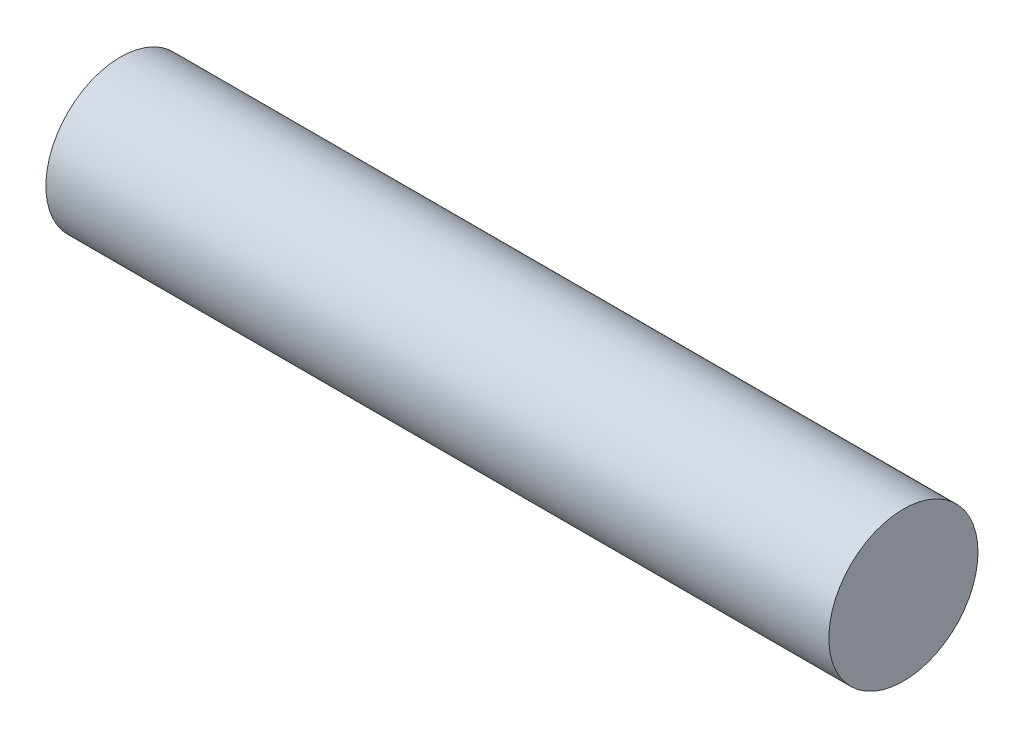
ISO-10303-21;
HEADER;
FILE_DESCRIPTION(('STEP AP214'),'2;1');
FILE_NAME('part.step','',(''),(''),'','','');
FILE_SCHEMA(('AUTOMOTIVE_DESIGN { 1 0 10303 214 1 1 1 1 }'));
ENDSEC;
DATA;
#1=APPLICATION_CONTEXT('core data for automotive mechanical design processes');
#2=APPLICATION_PROTOCOL_DEFINITION('international standard','automotive_design',2000,#1);
#3=PRODUCT_CONTEXT('',#1,'mechanical');
#4=PRODUCT('Part','Part','',(#3));
#5=PRODUCT_RELATED_PRODUCT_CATEGORY('part','',(#4));
#6=PRODUCT_DEFINITION_FORMATION('','',#4);
#7=PRODUCT_DEFINITION_CONTEXT('part definition',#1,'design');
#8=PRODUCT_DEFINITION('design','',#6,#7);
#9=PRODUCT_DEFINITION_SHAPE('','',#8);
#10=(LENGTH_UNIT() NAMED_UNIT(*) SI_UNIT(.MILLI.,.METRE.));
#11=(NAMED_UNIT(*) PLANE_ANGLE_UNIT() SI_UNIT($,.RADIAN.));
#12=(NAMED_UNIT(*) SI_UNIT($,.STERADIAN.) SOLID_ANGLE_UNIT());
#13=UNCERTAINTY_MEASURE_WITH_UNIT(LENGTH_MEASURE(1.E-05),#10,'distance_accuracy_value','');
#14=(GEOMETRIC_REPRESENTATION_CONTEXT(3) GLOBAL_UNCERTAINTY_ASSIGNED_CONTEXT((#13)) GLOBAL_UNIT_ASSIGNED_CONTEXT((#10,
#11,#12)) REPRESENTATION_CONTEXT('',''));
#15=CARTESIAN_POINT('',(0.,0.,0.));
#16=DIRECTION('',(0.,0.,1.));
#17=DIRECTION('',(1.,0.,0.));
#18=AXIS2_PLACEMENT_3D('',#15,#16,#17);
#19=CARTESIAN_POINT('',(50.,0.,0.));
#20=DIRECTION('',(-1.,0.,0.));
#21=DIRECTION('',(0.,0.,1.));
#22=AXIS2_PLACEMENT_3D('',#19,#20,#21);
#23=CYLINDRICAL_SURFACE('',#22,4.7625);
#24=CARTESIAN_POINT('',(50.,0.,0.));
#25=DIRECTION('',(1.,0.,0.));
#26=DIRECTION('',(0.,0.,-1.));
#27=AXIS2_PLACEMENT_3D('',#24,#25,#26);
#28=CIRCLE('',#27,4.7625);
#29=CARTESIAN_POINT('',(50.,0.,-4.7625));
#30=VERTEX_POINT('',#29);
#31=EDGE_CURVE('E10',#30,#30,#28,.T.);
#32=ORIENTED_EDGE('',*,*,#31,.F.);
#33=EDGE_LOOP('',(#32));
#34=FACE_BOUND('',#33,.T.);
#35=CARTESIAN_POINT('',(0.,0.,0.));
#36=DIRECTION('',(1.,0.,0.));
#37=DIRECTION('',(0.,0.,-1.));
#38=AXIS2_PLACEMENT_3D('',#35,#36,#37);
#39=CIRCLE('',#38,4.7625);
#40=CARTESIAN_POINT('',(0.,0.,-4.7625));
#41=VERTEX_POINT('',#40);
#42=EDGE_CURVE('E33',#41,#41,#39,.T.);
#43=ORIENTED_EDGE('',*,*,#42,.T.);
#44=EDGE_LOOP('',(#43));
#45=FACE_BOUND('',#44,.T.);
#46=ADVANCED_FACE('F30',(#34,#45),#23,.T.);
#47=CARTESIAN_POINT('',(50.,0.,0.));
#48=DIRECTION('',(1.,0.,0.));
#49=DIRECTION('',(0.,0.,-1.));
#50=AXIS2_PLACEMENT_3D('',#47,#48,#49);
#51=PLANE('',#50);
#52=ORIENTED_EDGE('',*,*,#31,.T.);
#53=EDGE_LOOP('',(#52));
#54=FACE_BOUND('',#53,.T.);
#55=ADVANCED_FACE('F45',(#54),#51,.T.);
#56=CARTESIAN_POINT('',(0.,0.,0.));
#57=DIRECTION('',(1.,0.,0.));
#58=DIRECTION('',(0.,0.,-1.));
#59=AXIS2_PLACEMENT_3D('',#56,#57,#58);
#60=PLANE('',#59);
#61=ORIENTED_EDGE('',*,*,#42,.F.);
#62=EDGE_LOOP('',(#61));
#63=FACE_BOUND('',#62,.T.);
#64=ADVANCED_FACE('F43',(#63),#60,.F.);
#65=CLOSED_SHELL('',(#46,#55,#64));
#66=MANIFOLD_SOLID_BREP('B2',#65);
#67=ADVANCED_BREP_SHAPE_REPRESENTATION('',(#18,#66),#14);
#68=SHAPE_DEFINITION_REPRESENTATION(#9,#67);
ENDSEC;
END-ISO-10303-21;
